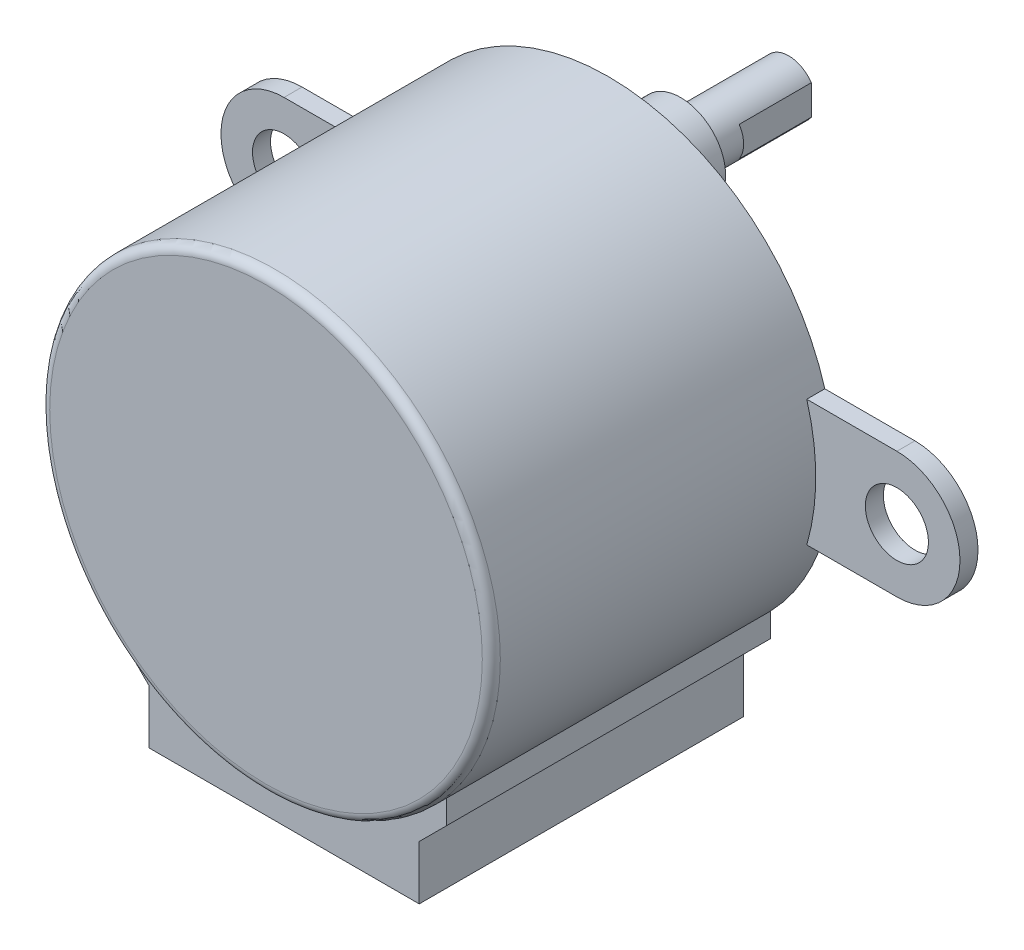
from build123d import *

# Parameters (mm, degrees)
ESQUISSE1_R             = 12.5
EXTRUSION1_DEPTH        = 19
EXTRUSION2_DEPTH        = 18
CONG_1_R                = 0.5
ESQUISSE3_R             = 1.75
EXTRUSION3_DEPTH        = 1
ESQUISSE4_R             = 3
EXTRUSION4_DEPTH        = 1
ESQUISSE5_R             = 2.5
EXTRUSION5_DEPTH        = 3
ESQUISSE6_R             = 1.5
EXTRUSION6_DEPTH        = 6
ENL_V_START             = -4
ENL_V_MAT_EXTRU_1_DEPTH = 4


with BuildPart() as part:
    # Esquisse1 → Extrusion1 (new body)
    with BuildSketch(Plane.XY):
        Circle(ESQUISSE1_R)
    extrude(amount=EXTRUSION1_DEPTH)

    # Esquisse2 → Extrusion2 (add)
    with BuildSketch(Plane(origin=(0, 0, 0), x_dir=(-1, 0, 0), z_dir=(0, 0, -1))):
        with BuildLine():
            Line((-9, -8.674675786), (-9, -10))
            Line((-9, -10), (-7.5, -11.5))
            Line((-7.5, -11.5), (-7.5, -14.5))
            Line((-7.5, -14.5), (7.5, -14.5))
            Line((7.5, -14.5), (7.5, -11.5))
            Line((7.5, -11.5), (9, -10))
            Line((9, -10), (9, -8.674675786))
            ThreePointArc((9, -8.674675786), (0, -12.5), (-9, -8.674675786))
        make_face()
    extrude(amount=-EXTRUSION2_DEPTH)

    # Cong_1
    cong_1_edges = [part.edges().sort_by_distance(p)[0] for p in [
        (-12.5, 0, 19),
    ]]
    fillet(cong_1_edges, radius=CONG_1_R)

    # Esquisse3 → Extrusion3 (add)
    with BuildSketch(Plane(origin=(0, 0, 0), x_dir=(-1, 0, 0), z_dir=(0, 0, -1))):
        with BuildLine():
            Line((17, 3.5), (12, 3.5))
            ThreePointArc((12, 3.5), (12.5, 0), (12, -3.5))
            Line((12, -3.5), (17, -3.5))
            ThreePointArc((17, -3.5), (20.5, 0), (17, 3.5))
        make_face()
        with Locations((17, 0)):
            Circle(ESQUISSE3_R, mode=Mode.SUBTRACT)
    extrusion3 = extrude(amount=-EXTRUSION3_DEPTH)

    # Sym_trie1: Extrusion3 across plane
    add(extrusion3.mirror(Plane(origin=(0, 0, 0), x_dir=(0, 0, 1), z_dir=(1, 0, 0))))

    # Esquisse4 → Extrusion4 (add)
    with BuildSketch(Plane(origin=(0, 0, 0), x_dir=(-1, 0, 0), z_dir=(0, 0, -1))):
        with Locations(Location((0, 7, 0), (0, 0, 180))):
            Circle(ESQUISSE4_R)
    extrude(amount=EXTRUSION4_DEPTH)

    # Esquisse5 → Extrusion5 (add)
    with BuildSketch(Plane(origin=(0, 0, -1), x_dir=(-1, 0, 0), z_dir=(0, 0, -1))):
        with Locations((0, 7)):
            Circle(ESQUISSE5_R)
    extrude(amount=EXTRUSION5_DEPTH)

    # Esquisse6 → Extrusion6 (add)
    with BuildSketch(Plane(origin=(0, 0, -4), x_dir=(-1, 0, 0), z_dir=(0, 0, -1))):
        with Locations((0, 7)):
            Circle(ESQUISSE6_R)
    extrude(amount=EXTRUSION6_DEPTH)

    # Esquisse7 → Enl_v. mat.-Extru.1 (cut)
    with BuildSketch(Plane(origin=(0, 0, -10), x_dir=(-1, 0, 0), z_dir=(0, 0, -1)).offset(ENL_V_START)):
        with BuildLine():
            Line((-1.25, 7.829156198), (-1.25, 6.170843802))
            ThreePointArc((-1.25, 6.170843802), (-1.5, 7), (-1.25, 7.829156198))
        make_face()
        with BuildLine():
            Line((1.25, 7.829156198), (1.25, 6.170843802))
            ThreePointArc((1.25, 6.170843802), (1.5, 7), (1.25, 7.829156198))
        make_face()
    extrude(amount=ENL_V_MAT_EXTRU_1_DEPTH, mode=Mode.SUBTRACT)


solid = part.part
